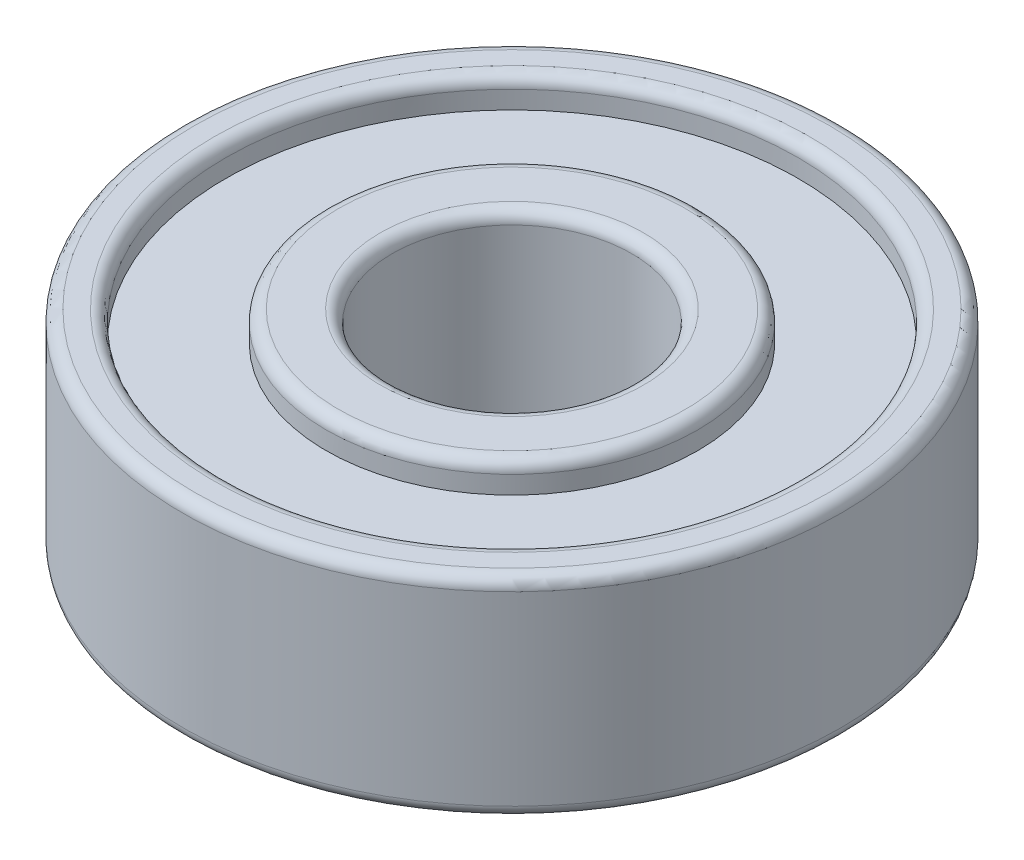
ISO-10303-21;
HEADER;
FILE_DESCRIPTION(('STEP AP214'),'2;1');
FILE_NAME('part.step','',(''),(''),'','','');
FILE_SCHEMA(('AUTOMOTIVE_DESIGN { 1 0 10303 214 1 1 1 1 }'));
ENDSEC;
DATA;
#1=APPLICATION_CONTEXT('core data for automotive mechanical design processes');
#2=APPLICATION_PROTOCOL_DEFINITION('international standard','automotive_design',2000,#1);
#3=PRODUCT_CONTEXT('',#1,'mechanical');
#4=PRODUCT('Part','Part','',(#3));
#5=PRODUCT_RELATED_PRODUCT_CATEGORY('part','',(#4));
#6=PRODUCT_DEFINITION_FORMATION('','',#4);
#7=PRODUCT_DEFINITION_CONTEXT('part definition',#1,'design');
#8=PRODUCT_DEFINITION('design','',#6,#7);
#9=PRODUCT_DEFINITION_SHAPE('','',#8);
#10=(LENGTH_UNIT() NAMED_UNIT(*) SI_UNIT(.MILLI.,.METRE.));
#11=(NAMED_UNIT(*) PLANE_ANGLE_UNIT() SI_UNIT($,.RADIAN.));
#12=(NAMED_UNIT(*) SI_UNIT($,.STERADIAN.) SOLID_ANGLE_UNIT());
#13=UNCERTAINTY_MEASURE_WITH_UNIT(LENGTH_MEASURE(1.E-05),#10,'distance_accuracy_value','');
#14=(GEOMETRIC_REPRESENTATION_CONTEXT(3) GLOBAL_UNCERTAINTY_ASSIGNED_CONTEXT((#13)) GLOBAL_UNIT_ASSIGNED_CONTEXT((#10,
#11,#12)) REPRESENTATION_CONTEXT('',''));
#15=CARTESIAN_POINT('',(0.,0.,0.));
#16=DIRECTION('',(0.,0.,1.));
#17=DIRECTION('',(1.,0.,0.));
#18=AXIS2_PLACEMENT_3D('',#15,#16,#17);
#19=CARTESIAN_POINT('',(1.11022302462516E-13,-1.66533453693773E-13,-2.77555756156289E-13));
#20=DIRECTION('',(0.,-1.,0.));
#21=DIRECTION('',(1.,0.,0.));
#22=AXIS2_PLACEMENT_3D('',#19,#20,#21);
#23=CYLINDRICAL_SURFACE('',#22,9.55);
#24=CARTESIAN_POINT('',(0.,0.399999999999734,-1.66533453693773E-13));
#25=DIRECTION('',(0.,-1.,0.));
#26=DIRECTION('',(1.,0.,0.));
#27=AXIS2_PLACEMENT_3D('',#24,#25,#26);
#28=CIRCLE('',#27,9.55);
#29=CARTESIAN_POINT('',(9.55000000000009,0.399999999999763,-1.30219446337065E-13));
#30=VERTEX_POINT('',#29);
#31=EDGE_CURVE('E50',#30,#30,#28,.T.);
#32=ORIENTED_EDGE('',*,*,#31,.T.);
#33=EDGE_LOOP('',(#32));
#34=FACE_BOUND('',#33,.T.);
#35=CARTESIAN_POINT('',(0.,0.999999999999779,-2.77555756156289E-13));
#36=DIRECTION('',(0.,-1.,0.));
#37=DIRECTION('',(1.,0.,0.));
#38=AXIS2_PLACEMENT_3D('',#35,#36,#37);
#39=CIRCLE('',#38,9.55000000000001);
#40=CARTESIAN_POINT('',(9.5500000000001,0.999999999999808,-2.41241748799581E-13));
#41=VERTEX_POINT('',#40);
#42=EDGE_CURVE('E104',#41,#41,#39,.T.);
#43=ORIENTED_EDGE('',*,*,#42,.F.);
#44=EDGE_LOOP('',(#43));
#45=FACE_BOUND('',#44,.T.);
#46=ADVANCED_FACE('F40',(#34,#45),#23,.F.);
#47=CARTESIAN_POINT('',(9.55000000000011,-4.9960036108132E-13,-2.77555756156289E-13));
#48=DIRECTION('',(0.,-1.,0.));
#49=DIRECTION('',(1.,0.,0.));
#50=AXIS2_PLACEMENT_3D('',#47,#48,#49);
#51=PLANE('',#50);
#52=CARTESIAN_POINT('',(1.11022302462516E-13,-1.66533453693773E-13,-2.77555756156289E-13));
#53=DIRECTION('',(0.,-1.,0.));
#54=DIRECTION('',(1.,0.,0.));
#55=AXIS2_PLACEMENT_3D('',#52,#53,#54);
#56=CIRCLE('',#55,9.95);
#57=CARTESIAN_POINT('',(9.95000000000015,-1.36569228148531E-13,-2.39720743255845E-13));
#58=VERTEX_POINT('',#57);
#59=EDGE_CURVE('E10',#58,#58,#56,.F.);
#60=ORIENTED_EDGE('',*,*,#59,.T.);
#61=EDGE_LOOP('',(#60));
#62=FACE_BOUND('',#61,.T.);
#63=CARTESIAN_POINT('',(1.11022302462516E-13,-1.66533453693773E-13,-2.77555756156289E-13));
#64=DIRECTION('',(0.,-1.,0.));
#65=DIRECTION('',(1.,0.,0.));
#66=AXIS2_PLACEMENT_3D('',#63,#64,#65);
#67=CIRCLE('',#66,10.6);
#68=CARTESIAN_POINT('',(10.6000000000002,-1.34611766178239E-13,-2.37249109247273E-13));
#69=VERTEX_POINT('',#68);
#70=EDGE_CURVE('E46',#69,#69,#67,.T.);
#71=ORIENTED_EDGE('',*,*,#70,.T.);
#72=EDGE_LOOP('',(#71));
#73=FACE_BOUND('',#72,.T.);
#74=ADVANCED_FACE('F112',(#62,#73),#51,.T.);
#75=CARTESIAN_POINT('',(1.11022302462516E-13,-1.66533453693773E-13,-2.77555756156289E-13));
#76=DIRECTION('',(0.,-1.,0.));
#77=DIRECTION('',(1.,0.,0.));
#78=AXIS2_PLACEMENT_3D('',#75,#76,#77);
#79=CYLINDRICAL_SURFACE('',#78,11.);
#80=CARTESIAN_POINT('',(5.82867087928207E-13,6.59999999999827,-2.77555756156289E-13));
#81=DIRECTION('',(0.,1.,0.));
#82=DIRECTION('',(-1.,0.,0.));
#83=AXIS2_PLACEMENT_3D('',#80,#81,#82);
#84=CIRCLE('',#83,11.);
#85=CARTESIAN_POINT('',(-10.9999999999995,6.59999999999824,-3.19383408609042E-13));
#86=VERTEX_POINT('',#85);
#87=EDGE_CURVE('E74',#86,#86,#84,.F.);
#88=ORIENTED_EDGE('',*,*,#87,.T.);
#89=EDGE_LOOP('',(#88));
#90=FACE_BOUND('',#89,.T.);
#91=CARTESIAN_POINT('',(0.,0.399999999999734,-1.66533453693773E-13));
#92=DIRECTION('',(0.,-1.,0.));
#93=DIRECTION('',(1.,0.,0.));
#94=AXIS2_PLACEMENT_3D('',#91,#92,#93);
#95=CIRCLE('',#94,11.);
#96=CARTESIAN_POINT('',(11.0000000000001,0.399999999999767,-1.24705801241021E-13));
#97=VERTEX_POINT('',#96);
#98=EDGE_CURVE('E77',#97,#97,#95,.F.);
#99=ORIENTED_EDGE('',*,*,#98,.T.);
#100=EDGE_LOOP('',(#99));
#101=FACE_BOUND('',#100,.T.);
#102=ADVANCED_FACE('F117',(#90,#101),#79,.T.);
#103=CARTESIAN_POINT('',(11.0000000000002,6.99999999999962,-1.66533453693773E-13));
#104=DIRECTION('',(0.,1.,0.));
#105=DIRECTION('',(-1.,0.,0.));
#106=AXIS2_PLACEMENT_3D('',#103,#104,#105);
#107=PLANE('',#106);
#108=CARTESIAN_POINT('',(1.66533453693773E-13,6.9999999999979,2.77555756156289E-13));
#109=DIRECTION('',(0.,1.,0.));
#110=DIRECTION('',(-1.,0.,0.));
#111=AXIS2_PLACEMENT_3D('',#108,#109,#110);
#112=CIRCLE('',#111,10.6);
#113=CARTESIAN_POINT('',(-10.5999999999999,6.99999999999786,2.37249109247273E-13));
#114=VERTEX_POINT('',#113);
#115=EDGE_CURVE('E68',#114,#114,#112,.T.);
#116=ORIENTED_EDGE('',*,*,#115,.T.);
#117=EDGE_LOOP('',(#116));
#118=FACE_BOUND('',#117,.T.);
#119=CARTESIAN_POINT('',(1.66533453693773E-13,6.9999999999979,2.77555756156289E-13));
#120=DIRECTION('',(0.,1.,0.));
#121=DIRECTION('',(-1.,0.,0.));
#122=AXIS2_PLACEMENT_3D('',#119,#120,#121);
#123=CIRCLE('',#122,9.95000000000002);
#124=CARTESIAN_POINT('',(-9.94999999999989,6.99999999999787,2.39720743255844E-13));
#125=VERTEX_POINT('',#124);
#126=EDGE_CURVE('E71',#125,#125,#123,.F.);
#127=ORIENTED_EDGE('',*,*,#126,.T.);
#128=EDGE_LOOP('',(#127));
#129=FACE_BOUND('',#128,.T.);
#130=ADVANCED_FACE('F184',(#118,#129),#107,.T.);
#131=CARTESIAN_POINT('',(1.11022302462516E-13,-1.66533453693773E-13,-2.77555756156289E-13));
#132=DIRECTION('',(0.,-1.,0.));
#133=DIRECTION('',(1.,0.,0.));
#134=AXIS2_PLACEMENT_3D('',#131,#132,#133);
#135=CYLINDRICAL_SURFACE('',#134,9.55000000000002);
#136=CARTESIAN_POINT('',(5.82867087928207E-13,6.59999999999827,-2.77555756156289E-13));
#137=DIRECTION('',(0.,1.,0.));
#138=DIRECTION('',(-1.,0.,0.));
#139=AXIS2_PLACEMENT_3D('',#136,#137,#138);
#140=CIRCLE('',#139,9.55000000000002);
#141=CARTESIAN_POINT('',(-9.54999999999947,6.59999999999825,-3.13869763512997E-13));
#142=VERTEX_POINT('',#141);
#143=EDGE_CURVE('E65',#142,#142,#140,.T.);
#144=ORIENTED_EDGE('',*,*,#143,.T.);
#145=EDGE_LOOP('',(#144));
#146=FACE_BOUND('',#145,.T.);
#147=CARTESIAN_POINT('',(6.66133814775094E-13,5.99999999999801,1.66533453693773E-13));
#148=DIRECTION('',(0.,-1.,0.));
#149=DIRECTION('',(1.,0.,0.));
#150=AXIS2_PLACEMENT_3D('',#147,#148,#149);
#151=CIRCLE('',#150,9.55000000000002);
#152=CARTESIAN_POINT('',(9.55000000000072,5.99999999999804,2.02847461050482E-13));
#153=VERTEX_POINT('',#152);
#154=EDGE_CURVE('E95',#153,#153,#151,.T.);
#155=ORIENTED_EDGE('',*,*,#154,.T.);
#156=EDGE_LOOP('',(#155));
#157=FACE_BOUND('',#156,.T.);
#158=ADVANCED_FACE('F180',(#146,#157),#135,.F.);
#159=CARTESIAN_POINT('',(9.55000000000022,5.99999999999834,-1.11022302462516E-13));
#160=DIRECTION('',(0.,1.,0.));
#161=DIRECTION('',(-1.,0.,0.));
#162=AXIS2_PLACEMENT_3D('',#159,#160,#161);
#163=PLANE('',#162);
#164=CARTESIAN_POINT('',(6.66133814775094E-13,5.99999999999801,1.66533453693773E-13));
#165=DIRECTION('',(0.,-1.,0.));
#166=DIRECTION('',(1.,0.,0.));
#167=AXIS2_PLACEMENT_3D('',#164,#165,#166);
#168=CIRCLE('',#167,6.20000000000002);
#169=CARTESIAN_POINT('',(6.20000000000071,5.99999999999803,1.90109039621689E-13));
#170=VERTEX_POINT('',#169);
#171=EDGE_CURVE('E98',#170,#170,#168,.T.);
#172=ORIENTED_EDGE('',*,*,#171,.T.);
#173=EDGE_LOOP('',(#172));
#174=FACE_BOUND('',#173,.T.);
#175=ORIENTED_EDGE('',*,*,#154,.F.);
#176=EDGE_LOOP('',(#175));
#177=FACE_BOUND('',#176,.T.);
#178=ADVANCED_FACE('F176',(#174,#177),#163,.T.);
#179=CARTESIAN_POINT('',(1.11022302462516E-13,-1.66533453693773E-13,-2.77555756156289E-13));
#180=DIRECTION('',(0.,-1.,0.));
#181=DIRECTION('',(1.,0.,0.));
#182=AXIS2_PLACEMENT_3D('',#179,#180,#181);
#183=CYLINDRICAL_SURFACE('',#182,6.20000000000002);
#184=CARTESIAN_POINT('',(5.82867087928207E-13,6.59999999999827,-2.77555756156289E-13));
#185=DIRECTION('',(0.,1.,0.));
#186=DIRECTION('',(-1.,0.,0.));
#187=AXIS2_PLACEMENT_3D('',#184,#185,#186);
#188=CIRCLE('',#187,6.20000000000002);
#189=CARTESIAN_POINT('',(-6.19999999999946,6.59999999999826,-3.01131342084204E-13));
#190=VERTEX_POINT('',#189);
#191=EDGE_CURVE('E92',#190,#190,#188,.F.);
#192=ORIENTED_EDGE('',*,*,#191,.T.);
#193=EDGE_LOOP('',(#192));
#194=FACE_BOUND('',#193,.T.);
#195=ORIENTED_EDGE('',*,*,#171,.F.);
#196=EDGE_LOOP('',(#195));
#197=FACE_BOUND('',#196,.T.);
#198=ADVANCED_FACE('F172',(#194,#197),#183,.T.);
#199=CARTESIAN_POINT('',(6.20000000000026,6.99999999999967,-3.33066907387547E-13));
#200=DIRECTION('',(0.,1.,0.));
#201=DIRECTION('',(-1.,0.,0.));
#202=AXIS2_PLACEMENT_3D('',#199,#200,#201);
#203=PLANE('',#202);
#204=CARTESIAN_POINT('',(1.66533453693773E-13,6.9999999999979,2.77555756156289E-13));
#205=DIRECTION('',(0.,1.,0.));
#206=DIRECTION('',(-1.,0.,0.));
#207=AXIS2_PLACEMENT_3D('',#204,#205,#206);
#208=CIRCLE('',#207,5.80000000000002);
#209=CARTESIAN_POINT('',(-5.79999999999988,6.99999999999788,2.5550117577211E-13));
#210=VERTEX_POINT('',#209);
#211=EDGE_CURVE('E86',#210,#210,#208,.T.);
#212=ORIENTED_EDGE('',*,*,#211,.T.);
#213=EDGE_LOOP('',(#212));
#214=FACE_BOUND('',#213,.T.);
#215=CARTESIAN_POINT('',(1.66533453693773E-13,6.9999999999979,2.77555756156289E-13));
#216=DIRECTION('',(0.,1.,0.));
#217=DIRECTION('',(-1.,0.,0.));
#218=AXIS2_PLACEMENT_3D('',#215,#216,#217);
#219=CIRCLE('',#218,4.40000000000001);
#220=CARTESIAN_POINT('',(-4.39999999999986,6.99999999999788,2.60824695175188E-13));
#221=VERTEX_POINT('',#220);
#222=EDGE_CURVE('E89',#221,#221,#219,.F.);
#223=ORIENTED_EDGE('',*,*,#222,.T.);
#224=EDGE_LOOP('',(#223));
#225=FACE_BOUND('',#224,.T.);
#226=ADVANCED_FACE('F168',(#214,#225),#203,.T.);
#227=CARTESIAN_POINT('',(1.11022302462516E-13,-1.66533453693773E-13,-2.77555756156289E-13));
#228=DIRECTION('',(0.,-1.,0.));
#229=DIRECTION('',(1.,0.,0.));
#230=AXIS2_PLACEMENT_3D('',#227,#228,#229);
#231=CYLINDRICAL_SURFACE('',#230,4.00000000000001);
#232=CARTESIAN_POINT('',(5.82867087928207E-13,6.59999999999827,-2.77555756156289E-13));
#233=DIRECTION('',(0.,1.,0.));
#234=DIRECTION('',(-1.,0.,0.));
#235=AXIS2_PLACEMENT_3D('',#232,#233,#234);
#236=CIRCLE('',#235,4.00000000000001);
#237=CARTESIAN_POINT('',(-3.99999999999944,6.59999999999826,-2.92765811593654E-13));
#238=VERTEX_POINT('',#237);
#239=EDGE_CURVE('E80',#238,#238,#236,.T.);
#240=ORIENTED_EDGE('',*,*,#239,.T.);
#241=EDGE_LOOP('',(#240));
#242=FACE_BOUND('',#241,.T.);
#243=CARTESIAN_POINT('',(0.,0.399999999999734,-1.66533453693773E-13));
#244=DIRECTION('',(0.,-1.,0.));
#245=DIRECTION('',(1.,0.,0.));
#246=AXIS2_PLACEMENT_3D('',#243,#244,#245);
#247=CIRCLE('',#246,4.00000000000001);
#248=CARTESIAN_POINT('',(4.00000000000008,0.399999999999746,-1.51323398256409E-13));
#249=VERTEX_POINT('',#248);
#250=EDGE_CURVE('E83',#249,#249,#247,.T.);
#251=ORIENTED_EDGE('',*,*,#250,.T.);
#252=EDGE_LOOP('',(#251));
#253=FACE_BOUND('',#252,.T.);
#254=ADVANCED_FACE('F164',(#242,#253),#231,.F.);
#255=CARTESIAN_POINT('',(4.00000000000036,-1.33226762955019E-12,-2.22044604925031E-13));
#256=DIRECTION('',(0.,-1.,0.));
#257=DIRECTION('',(1.,0.,0.));
#258=AXIS2_PLACEMENT_3D('',#255,#256,#257);
#259=PLANE('',#258);
#260=CARTESIAN_POINT('',(1.11022302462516E-13,-1.66533453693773E-13,-2.77555756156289E-13));
#261=DIRECTION('',(0.,-1.,0.));
#262=DIRECTION('',(1.,0.,0.));
#263=AXIS2_PLACEMENT_3D('',#260,#261,#262);
#264=CIRCLE('',#263,4.40000000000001);
#265=CARTESIAN_POINT('',(4.40000000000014,-1.53282941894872E-13,-2.60824695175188E-13));
#266=VERTEX_POINT('',#265);
#267=EDGE_CURVE('E59',#266,#266,#264,.F.);
#268=ORIENTED_EDGE('',*,*,#267,.T.);
#269=EDGE_LOOP('',(#268));
#270=FACE_BOUND('',#269,.T.);
#271=CARTESIAN_POINT('',(1.11022302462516E-13,-1.66533453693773E-13,-2.77555756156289E-13));
#272=DIRECTION('',(0.,-1.,0.));
#273=DIRECTION('',(1.,0.,0.));
#274=AXIS2_PLACEMENT_3D('',#271,#272,#273);
#275=CIRCLE('',#274,5.8);
#276=CARTESIAN_POINT('',(5.80000000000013,-1.49066869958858E-13,-2.5550117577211E-13));
#277=VERTEX_POINT('',#276);
#278=EDGE_CURVE('E62',#277,#277,#275,.T.);
#279=ORIENTED_EDGE('',*,*,#278,.T.);
#280=EDGE_LOOP('',(#279));
#281=FACE_BOUND('',#280,.T.);
#282=ADVANCED_FACE('F160',(#270,#281),#259,.T.);
#283=CARTESIAN_POINT('',(1.11022302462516E-13,-1.66533453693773E-13,-2.77555756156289E-13));
#284=DIRECTION('',(0.,-1.,0.));
#285=DIRECTION('',(1.,0.,0.));
#286=AXIS2_PLACEMENT_3D('',#283,#284,#285);
#287=CYLINDRICAL_SURFACE('',#286,6.2);
#288=CARTESIAN_POINT('',(0.,0.399999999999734,-1.66533453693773E-13));
#289=DIRECTION('',(0.,-1.,0.));
#290=DIRECTION('',(1.,0.,0.));
#291=AXIS2_PLACEMENT_3D('',#288,#289,#290);
#292=CIRCLE('',#291,6.2);
#293=CARTESIAN_POINT('',(6.20000000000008,0.399999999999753,-1.42957867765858E-13));
#294=VERTEX_POINT('',#293);
#295=EDGE_CURVE('E54',#294,#294,#292,.F.);
#296=ORIENTED_EDGE('',*,*,#295,.T.);
#297=EDGE_LOOP('',(#296));
#298=FACE_BOUND('',#297,.T.);
#299=CARTESIAN_POINT('',(0.,0.999999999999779,-2.77555756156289E-13));
#300=DIRECTION('',(0.,-1.,0.));
#301=DIRECTION('',(1.,0.,0.));
#302=AXIS2_PLACEMENT_3D('',#299,#300,#301);
#303=CIRCLE('',#302,6.2);
#304=CARTESIAN_POINT('',(6.20000000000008,0.999999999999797,-2.53980170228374E-13));
#305=VERTEX_POINT('',#304);
#306=EDGE_CURVE('E101',#305,#305,#303,.T.);
#307=ORIENTED_EDGE('',*,*,#306,.T.);
#308=EDGE_LOOP('',(#307));
#309=FACE_BOUND('',#308,.T.);
#310=ADVANCED_FACE('F157',(#298,#309),#287,.T.);
#311=CARTESIAN_POINT('',(6.20000000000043,0.999999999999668,-2.77555756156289E-13));
#312=DIRECTION('',(0.,-1.,0.));
#313=DIRECTION('',(1.,0.,0.));
#314=AXIS2_PLACEMENT_3D('',#311,#312,#313);
#315=PLANE('',#314);
#316=ORIENTED_EDGE('',*,*,#42,.T.);
#317=EDGE_LOOP('',(#316));
#318=FACE_BOUND('',#317,.T.);
#319=ORIENTED_EDGE('',*,*,#306,.F.);
#320=EDGE_LOOP('',(#319));
#321=FACE_BOUND('',#320,.T.);
#322=ADVANCED_FACE('F108',(#318,#321),#315,.T.);
#323=CARTESIAN_POINT('',(5.82867087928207E-13,6.59999999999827,-2.77555756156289E-13));
#324=DIRECTION('',(0.,1.,0.));
#325=DIRECTION('',(-1.,0.,0.));
#326=AXIS2_PLACEMENT_3D('',#323,#324,#325);
#327=TOROIDAL_SURFACE('',#326,5.80000000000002,0.4);
#328=ORIENTED_EDGE('',*,*,#211,.F.);
#329=EDGE_LOOP('',(#328));
#330=FACE_BOUND('',#329,.T.);
#331=ORIENTED_EDGE('',*,*,#191,.F.);
#332=EDGE_LOOP('',(#331));
#333=FACE_BOUND('',#332,.T.);
#334=ADVANCED_FACE('F150',(#330,#333),#327,.T.);
#335=CARTESIAN_POINT('',(5.82867087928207E-13,6.59999999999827,-2.77555756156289E-13));
#336=DIRECTION('',(0.,1.,0.));
#337=DIRECTION('',(-1.,0.,0.));
#338=AXIS2_PLACEMENT_3D('',#335,#336,#337);
#339=TOROIDAL_SURFACE('',#338,4.40000000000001,0.4);
#340=ORIENTED_EDGE('',*,*,#239,.F.);
#341=EDGE_LOOP('',(#340));
#342=FACE_BOUND('',#341,.T.);
#343=ORIENTED_EDGE('',*,*,#222,.F.);
#344=EDGE_LOOP('',(#343));
#345=FACE_BOUND('',#344,.T.);
#346=ADVANCED_FACE('F146',(#342,#345),#339,.T.);
#347=CARTESIAN_POINT('',(5.82867087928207E-13,6.59999999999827,-2.77555756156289E-13));
#348=DIRECTION('',(0.,1.,0.));
#349=DIRECTION('',(-1.,0.,0.));
#350=AXIS2_PLACEMENT_3D('',#347,#348,#349);
#351=TOROIDAL_SURFACE('',#350,10.6,0.4);
#352=ORIENTED_EDGE('',*,*,#115,.F.);
#353=EDGE_LOOP('',(#352));
#354=FACE_BOUND('',#353,.T.);
#355=ORIENTED_EDGE('',*,*,#87,.F.);
#356=EDGE_LOOP('',(#355));
#357=FACE_BOUND('',#356,.T.);
#358=ADVANCED_FACE('F142',(#354,#357),#351,.T.);
#359=CARTESIAN_POINT('',(5.82867087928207E-13,6.59999999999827,-2.77555756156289E-13));
#360=DIRECTION('',(0.,1.,0.));
#361=DIRECTION('',(-1.,0.,0.));
#362=AXIS2_PLACEMENT_3D('',#359,#360,#361);
#363=TOROIDAL_SURFACE('',#362,9.95000000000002,0.4);
#364=ORIENTED_EDGE('',*,*,#143,.F.);
#365=EDGE_LOOP('',(#364));
#366=FACE_BOUND('',#365,.T.);
#367=ORIENTED_EDGE('',*,*,#126,.F.);
#368=EDGE_LOOP('',(#367));
#369=FACE_BOUND('',#368,.T.);
#370=ADVANCED_FACE('F138',(#366,#369),#363,.T.);
#371=CARTESIAN_POINT('',(0.,0.399999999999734,-1.66533453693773E-13));
#372=DIRECTION('',(0.,-1.,0.));
#373=DIRECTION('',(1.,0.,0.));
#374=AXIS2_PLACEMENT_3D('',#371,#372,#373);
#375=TOROIDAL_SURFACE('',#374,4.40000000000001,0.4);
#376=ORIENTED_EDGE('',*,*,#267,.F.);
#377=EDGE_LOOP('',(#376));
#378=FACE_BOUND('',#377,.T.);
#379=ORIENTED_EDGE('',*,*,#250,.F.);
#380=EDGE_LOOP('',(#379));
#381=FACE_BOUND('',#380,.T.);
#382=ADVANCED_FACE('F132',(#378,#381),#375,.T.);
#383=CARTESIAN_POINT('',(0.,0.399999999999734,-1.66533453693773E-13));
#384=DIRECTION('',(0.,-1.,0.));
#385=DIRECTION('',(1.,0.,0.));
#386=AXIS2_PLACEMENT_3D('',#383,#384,#385);
#387=TOROIDAL_SURFACE('',#386,5.8,0.4);
#388=ORIENTED_EDGE('',*,*,#295,.F.);
#389=EDGE_LOOP('',(#388));
#390=FACE_BOUND('',#389,.T.);
#391=ORIENTED_EDGE('',*,*,#278,.F.);
#392=EDGE_LOOP('',(#391));
#393=FACE_BOUND('',#392,.T.);
#394=ADVANCED_FACE('F123',(#390,#393),#387,.T.);
#395=CARTESIAN_POINT('',(0.,0.399999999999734,-1.66533453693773E-13));
#396=DIRECTION('',(0.,-1.,0.));
#397=DIRECTION('',(1.,0.,0.));
#398=AXIS2_PLACEMENT_3D('',#395,#396,#397);
#399=TOROIDAL_SURFACE('',#398,9.95,0.4);
#400=ORIENTED_EDGE('',*,*,#59,.F.);
#401=EDGE_LOOP('',(#400));
#402=FACE_BOUND('',#401,.T.);
#403=ORIENTED_EDGE('',*,*,#31,.F.);
#404=EDGE_LOOP('',(#403));
#405=FACE_BOUND('',#404,.T.);
#406=ADVANCED_FACE('F120',(#402,#405),#399,.T.);
#407=CARTESIAN_POINT('',(0.,0.399999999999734,-1.66533453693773E-13));
#408=DIRECTION('',(0.,-1.,0.));
#409=DIRECTION('',(1.,0.,0.));
#410=AXIS2_PLACEMENT_3D('',#407,#408,#409);
#411=TOROIDAL_SURFACE('',#410,10.6,0.4);
#412=ORIENTED_EDGE('',*,*,#98,.F.);
#413=EDGE_LOOP('',(#412));
#414=FACE_BOUND('',#413,.T.);
#415=ORIENTED_EDGE('',*,*,#70,.F.);
#416=EDGE_LOOP('',(#415));
#417=FACE_BOUND('',#416,.T.);
#418=ADVANCED_FACE('F122',(#414,#417),#411,.T.);
#419=CLOSED_SHELL('',(#46,#74,#102,#130,#158,#178,#198,#226,#254,#282,#310,#322,#334,#346,#358,
#370,#382,#394,#406,#418));
#420=MANIFOLD_SOLID_BREP('B2',#419);
#421=ADVANCED_BREP_SHAPE_REPRESENTATION('',(#18,#420),#14);
#422=SHAPE_DEFINITION_REPRESENTATION(#9,#421);
ENDSEC;
END-ISO-10303-21;
